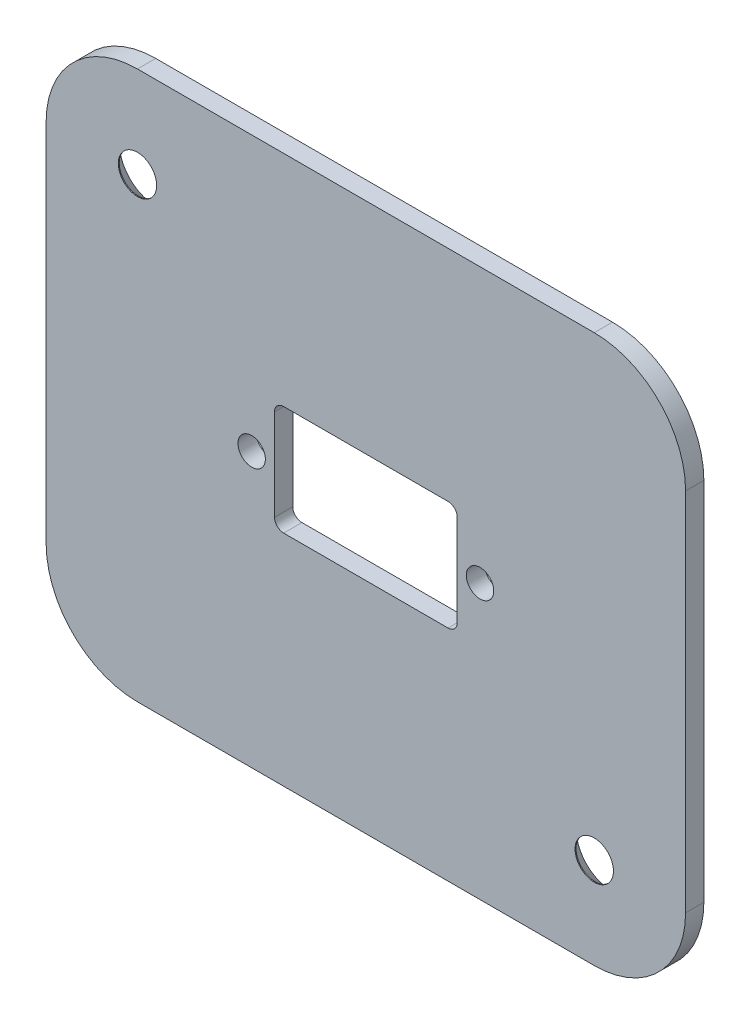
from build123d import *

# Parameters (mm, degrees)
ESQUISSE1_W             = 70
ESQUISSE1_H             = 60
BOSS_EXTRU_1_DEPTH      = 2
CONG_1_R                = 10
ESQUISSE2_R             = 2.1
ENL_V_MAT_EXTRU_1_DEPTH = 93.217135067
CHANFREIN1_SIZE         = 1.9
ESQUISSE3_R             = 1.5
ENL_V_MAT_EXTRU_2_DEPTH = 93.217135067
ENL_V_MAT_EXTRU_3_DEPTH = 1


with BuildPart() as part:
    # Esquisse1 → Boss.-Extru.1 (new body)
    with BuildSketch(Plane.XY):
        with Locations((35, 30)):
            Rectangle(ESQUISSE1_W, ESQUISSE1_H)
    extrude(amount=-BOSS_EXTRU_1_DEPTH)

    # Cong_1
    cong_1_edges = [part.edges().sort_by_distance(p)[0] for p in [
        (0, 60, -1),
        (70, 60, -1),
        (70, 0, -1),
        (0, 0, -1),
    ]]
    fillet(cong_1_edges, radius=CONG_1_R)

    # Esquisse2 → Enl_v. mat.-Extru.1 (cut, through all)
    with BuildSketch(Plane.XY):
        with Locations((10, 50)):
            Circle(ESQUISSE2_R)
        with Locations((60, 10)):
            Circle(ESQUISSE2_R)
    extrude(amount=-ENL_V_MAT_EXTRU_1_DEPTH, mode=Mode.SUBTRACT)

    # Chanfrein1
    chanfrein1_edges = [part.edges().sort_by_distance(p)[0] for p in [
        (7.9, 50, -2),
        (57.9, 10, -2),
    ]]
    chamfer(chanfrein1_edges, length=CHANFREIN1_SIZE)

    # Esquisse3 → Enl_v. mat.-Extru.2 (cut, through all)
    with BuildSketch(Plane(origin=(0, 0, -2), x_dir=(-1, 0, 0), z_dir=(0, 0, -1))):
        with Locations((-22.5, 30)):
            Circle(ESQUISSE3_R)
        with Locations((-47.5, 30)):
            Circle(ESQUISSE3_R)
        with BuildLine():
            Line((-44, 36), (-26, 36))
            ThreePointArc((-26, 36), (-25.292893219, 35.707106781), (-25, 35))
            Line((-25, 35), (-25, 25))
            ThreePointArc((-25, 25), (-25.292893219, 24.292893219), (-26, 24))
            Line((-26, 24), (-44, 24))
            ThreePointArc((-44, 24), (-44.707106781, 24.292893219), (-45, 25))
            Line((-45, 25), (-45, 35))
            ThreePointArc((-45, 35), (-44.707106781, 35.707106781), (-44, 36))
        make_face()
    extrude(amount=-ENL_V_MAT_EXTRU_2_DEPTH, mode=Mode.SUBTRACT)

    # Esquisse4 → Enl_v. mat.-Extru.3 (cut)
    # profile 1 of 4: a face of its own
    with BuildSketch(Plane(origin=(0, 0, -2), x_dir=(-1, 0, 0), z_dir=(0, 0, -1))):
        with BuildLine():
            Line((-39.296031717, 22.173881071), (-39.054144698, 21.983877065))
            Line((-39.054144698, 21.983877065), (-39.978924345, 20.569714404))
            add(Edge.make_bspline(
                [(-39.978924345, 20.569714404), (-39.917354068, 20.579528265), (-39.797254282, 20.59867131), (-39.675688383, 20.601829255), (-39.616444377, 20.603368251)],
                knots=[0, 0, 0, 0, 1.025318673, 2, 2, 2, 2], degree=3))
            add(Edge.make_bspline(
                [(-39.616444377, 20.603368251), (-39.580871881, 20.602412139), (-39.510848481, 20.600530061), (-39.408041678, 20.586046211), (-39.309252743, 20.563221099), (-39.21489113, 20.529948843), (-39.124618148, 20.487446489), (-39.037915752, 20.436507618), (-38.956413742, 20.374501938), (-38.879062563, 20.305236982), (-38.808835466, 20.228519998), (-38.74665941, 20.147118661), (-38.694432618, 20.06111778), (-38.652058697, 19.970560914), (-38.619153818, 19.875587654), (-38.595166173, 19.776319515), (-38.58098658, 19.672688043), (-38.579061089, 19.602209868), (-38.578082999, 19.566409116)],
                knots=[0, 0, 0, 0, 1.04369286, 2.054478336, 3.041073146, 4.015093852, 4.984733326, 5.965804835, 6.960378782, 7.985147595, 9.009457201, 10.008161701, 10.986880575, 11.956520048, 12.937015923, 13.931873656, 14.949455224, 16, 16, 16, 16], degree=3))
            add(Edge.make_bspline(
                [(-38.578082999, 19.566409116), (-38.579506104, 19.517429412), (-38.582306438, 19.421048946), (-38.610210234, 19.28067224), (-38.653569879, 19.146939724), (-38.715547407, 19.021986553), (-38.79252979, 18.905983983), (-38.886407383, 18.803198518), (-38.993850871, 18.71152848), (-39.115337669, 18.634871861), (-39.246080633, 18.57226881), (-39.383432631, 18.527303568), (-39.526059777, 18.499620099), (-39.622864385, 18.496149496), (-39.671832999, 18.494393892)],
                knots=[0, 0, 0, 0, 1.031375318, 2.029502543, 3.004789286, 3.987476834, 4.960371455, 5.9300674, 6.912260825, 7.929083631, 8.949397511, 9.960523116, 10.96833055, 12, 12, 12, 12], degree=3))
            add(Edge.make_bspline(
                [(-39.671832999, 18.494393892), (-39.7189297, 18.495922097), (-39.812220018, 18.498949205), (-39.949452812, 18.525915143), (-40.081315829, 18.569622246), (-40.20688521, 18.629836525), (-40.323205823, 18.705894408), (-40.42727146, 18.797456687), (-40.518563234, 18.902566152), (-40.594537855, 19.021206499), (-40.654796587, 19.148696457), (-40.699986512, 19.281633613), (-40.726382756, 19.419533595), (-40.730071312, 19.513014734), (-40.731929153, 19.56009902)],
                knots=[0, 0, 0, 0, 1.012016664, 2.004627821, 2.994792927, 3.992885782, 4.990978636, 5.973936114, 6.964471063, 7.975201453, 8.993600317, 9.990122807, 10.98767138, 12, 12, 12, 12], degree=3))
            add(Edge.make_bspline(
                [(-40.731929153, 19.56009902), (-40.730747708, 19.596143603), (-40.728335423, 19.669739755), (-40.711492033, 19.781203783), (-40.684427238, 19.895254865), (-40.654116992, 19.992009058), (-40.622091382, 20.07127058), (-40.595438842, 20.135174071), (-40.562264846, 20.200935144), (-40.526891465, 20.27080878), (-40.486134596, 20.342994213), (-40.441818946, 20.418697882), (-40.392719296, 20.49671581), (-40.358299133, 20.549660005), (-40.340703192, 20.576725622)],
                knots=[0, 0, 0, 0, 1.173818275, 2.396712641, 3.66331629, 4.989737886, 5.693666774, 6.447286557, 7.243889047, 8.091586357, 8.998013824, 9.943181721, 10.948533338, 12, 12, 12, 12], degree=3))
            Line((-40.340703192, 20.576725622), (-39.296031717, 22.173881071))
        make_face()
        with BuildLine():
            add(Edge.make_bspline(
                [(-39.682349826, 20.244393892), (-39.709012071, 20.243615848), (-39.76109118, 20.242096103), (-39.837498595, 20.233270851), (-39.909811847, 20.216651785), (-39.97898898, 20.195485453), (-40.043736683, 20.166382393), (-40.104525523, 20.131030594), (-40.161590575, 20.089409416), (-40.214334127, 20.042108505), (-40.26215379, 19.990320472), (-40.303334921, 19.93485095), (-40.338857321, 19.877036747), (-40.36773914, 19.816394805), (-40.390229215, 19.752948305), (-40.406497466, 19.686989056), (-40.415551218, 19.61807475), (-40.417057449, 19.571342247), (-40.417826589, 19.547478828)],
                knots=[0, 0, 0, 0, 1.129588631, 2.206414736, 3.251139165, 4.268635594, 5.265702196, 6.250456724, 7.242448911, 8.251968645, 9.246821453, 10.222880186, 11.173611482, 12.116736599, 13.062300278, 14.020270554, 14.989073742, 16, 16, 16, 16], degree=3))
            add(Edge.make_bspline(
                [(-40.417826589, 19.547478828), (-40.417200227, 19.523828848), (-40.415972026, 19.477454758), (-40.404819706, 19.409115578), (-40.387784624, 19.34335067), (-40.362444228, 19.280499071), (-40.33221734, 19.219602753), (-40.292312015, 19.162867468), (-40.24809523, 19.106847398), (-40.195241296, 19.055845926), (-40.138517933, 19.008389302), (-40.077916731, 18.966909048), (-40.014756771, 18.931422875), (-39.948185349, 18.903611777), (-39.879146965, 18.880787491), (-39.807066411, 18.864726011), (-39.731893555, 18.855645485), (-39.680971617, 18.854137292), (-39.655006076, 18.853368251)],
                knots=[0, 0, 0, 0, 0.989467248, 1.94019797, 2.891935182, 3.827694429, 4.772920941, 5.730924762, 6.725747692, 7.756678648, 8.79901574, 9.819492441, 10.826891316, 11.826466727, 12.835195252, 13.867842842, 14.912794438, 16, 16, 16, 16], degree=3))
            add(Edge.make_bspline(
                [(-39.655006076, 18.853368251), (-39.629040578, 18.854137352), (-39.578118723, 18.855645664), (-39.502945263, 18.864725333), (-39.430866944, 18.880789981), (-39.361820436, 18.903602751), (-39.295279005, 18.93145636), (-39.232174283, 18.96668828), (-39.172146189, 19.008644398), (-39.11538559, 19.055764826), (-39.062751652, 19.107137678), (-39.017474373, 19.162367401), (-38.978791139, 19.220061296), (-38.947356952, 19.280259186), (-38.922295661, 19.343388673), (-38.905174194, 19.409105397), (-38.894044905, 19.477457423), (-38.892813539, 19.523829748), (-38.892185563, 19.547478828)],
                knots=[0, 0, 0, 0, 1.087397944, 2.132534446, 3.165364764, 4.174271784, 5.174024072, 6.181601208, 7.194203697, 8.236725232, 9.267838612, 10.269026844, 11.221737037, 12.171628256, 13.107553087, 14.05945871, 15.010357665, 16, 16, 16, 16], degree=3))
            add(Edge.make_bspline(
                [(-38.892185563, 19.547478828), (-38.892735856, 19.571373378), (-38.893815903, 19.618270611), (-38.906031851, 19.686958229), (-38.922974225, 19.753283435), (-38.948557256, 19.816829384), (-38.9817938, 19.877345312), (-39.022277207, 19.935136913), (-39.069109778, 19.99064726), (-39.123207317, 20.042210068), (-39.182097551, 20.089357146), (-39.244713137, 20.130976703), (-39.31022111, 20.166101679), (-39.378555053, 20.195408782), (-39.450497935, 20.216558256), (-39.524888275, 20.233211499), (-39.602677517, 20.242073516), (-39.655454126, 20.243610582), (-39.682349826, 20.244393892)],
                knots=[0, 0, 0, 0, 0.978206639, 1.919901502, 2.851605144, 3.780102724, 4.718870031, 5.675451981, 6.667674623, 7.690630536, 8.733308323, 9.756129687, 10.767539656, 11.776269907, 12.797430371, 13.836405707, 14.897401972, 16, 16, 16, 16], degree=3))
        make_face(mode=Mode.SUBTRACT)
    # profile 2 of 4: a face of its own
    with BuildSketch(Plane(origin=(0, 0, -2), x_dir=(-1, 0, 0), z_dir=(0, 0, -1))):
        with BuildLine():
            add(Edge.make_bspline(
                [(-38.21910864, 20.332735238), (-38.218780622, 20.388832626), (-38.218143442, 20.49780261), (-38.211055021, 20.656587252), (-38.199279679, 20.805547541), (-38.183142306, 20.944690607), (-38.163504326, 21.074052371), (-38.137288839, 21.193287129), (-38.107476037, 21.302946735), (-38.072923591, 21.403388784), (-38.033935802, 21.495966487), (-37.991501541, 21.582391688), (-37.943936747, 21.66253362), (-37.893959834, 21.737671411), (-37.839547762, 21.806575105), (-37.782248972, 21.870217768), (-37.719827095, 21.927128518), (-37.654404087, 21.978974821), (-37.585387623, 22.024424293), (-37.514744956, 22.064457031), (-37.441989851, 22.098656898), (-37.366923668, 22.125547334), (-37.29022111, 22.147758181), (-37.211614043, 22.162947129), (-37.130972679, 22.172504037), (-37.076541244, 22.173417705), (-37.048936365, 22.173881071)],
                knots=[0, 0, 0, 0, 1.646270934, 3.197905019, 4.663502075, 6.030701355, 7.308322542, 8.50163776, 9.611534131, 10.641858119, 11.616356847, 12.558055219, 13.465016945, 14.349605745, 15.204443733, 16.039544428, 16.859896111, 17.680448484, 18.487036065, 19.28249412, 20.06191084, 20.843045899, 21.620316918, 22.403196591, 23.190181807, 24, 24, 24, 24], degree=3))
            add(Edge.make_bspline(
                [(-37.048936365, 22.173881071), (-37.021100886, 22.173393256), (-36.965744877, 22.172423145), (-36.883904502, 22.163099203), (-36.80395482, 22.147628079), (-36.726236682, 22.125707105), (-36.650111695, 22.098511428), (-36.576175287, 22.064424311), (-36.503968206, 22.024745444), (-36.434637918, 21.978121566), (-36.367423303, 21.92613929), (-36.30397534, 21.867376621), (-36.244288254, 21.802426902), (-36.187612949, 21.731985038), (-36.135557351, 21.654699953), (-36.085983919, 21.571915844), (-36.041611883, 21.482184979), (-35.998877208, 21.387004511), (-35.961990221, 21.283740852), (-35.928723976, 21.172976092), (-35.901845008, 21.053401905), (-35.879455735, 20.925645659), (-35.862110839, 20.789238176), (-35.849478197, 20.644471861), (-35.842805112, 20.49125147), (-35.841548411, 20.386493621), (-35.840903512, 20.332735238)],
                knots=[0, 0, 0, 0, 0.810914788, 1.612654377, 2.396697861, 3.181598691, 3.963628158, 4.749916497, 5.551656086, 6.361998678, 7.18212741, 8.025565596, 8.878627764, 9.750805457, 10.657531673, 11.591944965, 12.560506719, 13.57287815, 14.630710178, 15.753379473, 16.941251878, 18.199788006, 19.531962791, 20.947069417, 22.433333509, 24, 24, 24, 24], degree=3))
            add(Edge.make_bspline(
                [(-35.840903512, 20.332735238), (-35.841555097, 20.27921133), (-35.842824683, 20.174922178), (-35.849403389, 20.022391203), (-35.86236202, 19.878393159), (-35.878572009, 19.742582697), (-35.901022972, 19.615525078), (-35.928628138, 19.49678063), (-35.959278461, 19.385836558), (-35.997113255, 19.283601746), (-36.038523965, 19.188650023), (-36.083579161, 19.099982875), (-36.131848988, 19.016816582), (-36.184437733, 18.939816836), (-36.240491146, 18.868438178), (-36.301208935, 18.803940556), (-36.36487952, 18.744769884), (-36.432291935, 18.692118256), (-36.502703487, 18.646033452), (-36.574662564, 18.604819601), (-36.649445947, 18.571586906), (-36.7253589, 18.543051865), (-36.803487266, 18.521251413), (-36.883733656, 18.506177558), (-36.965689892, 18.495605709), (-37.021091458, 18.49479923), (-37.048936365, 18.494393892)],
                knots=[0, 0, 0, 0, 1.561518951, 3.042555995, 4.452378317, 5.7783523, 7.031515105, 8.214008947, 9.334062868, 10.386615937, 11.391082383, 12.354592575, 13.286541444, 14.194233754, 15.072674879, 15.931287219, 16.775624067, 17.606195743, 18.42308326, 19.229000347, 20.022332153, 20.807536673, 21.593273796, 22.3848459, 23.188221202, 24, 24, 24, 24], degree=3))
            add(Edge.make_bspline(
                [(-37.048936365, 18.494393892), (-37.076540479, 18.494860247), (-37.130970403, 18.495779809), (-37.211622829, 18.505293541), (-37.289905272, 18.520589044), (-37.366204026, 18.542005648), (-37.440910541, 18.568220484), (-37.513006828, 18.602374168), (-37.583294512, 18.641708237), (-37.651586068, 18.686503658), (-37.716598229, 18.737825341), (-37.778696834, 18.79458963), (-37.836321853, 18.858213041), (-37.889955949, 18.927690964), (-37.940930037, 19.002384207), (-37.98781941, 19.08331258), (-38.031190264, 19.17015519), (-38.070833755, 19.263473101), (-38.105982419, 19.364628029), (-38.137030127, 19.474777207), (-38.161544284, 19.594892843), (-38.182527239, 19.72401021), (-38.199451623, 19.862684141), (-38.211005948, 20.010989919), (-38.218147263, 20.168835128), (-38.218782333, 20.277104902), (-38.21910864, 20.332735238)],
                knots=[0, 0, 0, 0, 0.810891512, 1.598919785, 2.382837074, 3.152667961, 3.926044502, 4.706494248, 5.493654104, 6.291793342, 7.103789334, 7.925228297, 8.761435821, 9.622817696, 10.50288917, 11.416980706, 12.369136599, 13.353924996, 14.394355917, 15.514179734, 16.714354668, 17.994756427, 19.357759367, 20.818452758, 22.365282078, 24, 24, 24, 24], degree=3))
        make_face()
        with BuildLine():
            add(Edge.make_bspline(
                [(-37.905006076, 20.334137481), (-37.904886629, 20.287388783), (-37.904654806, 20.196658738), (-37.898598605, 20.064815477), (-37.890348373, 19.941845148), (-37.879707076, 19.827591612), (-37.863904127, 19.722441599), (-37.84619734, 19.625671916), (-37.82464925, 19.537794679), (-37.799154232, 19.458206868), (-37.770115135, 19.3855578), (-37.738409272, 19.317956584), (-37.704348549, 19.254604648), (-37.666229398, 19.19607104), (-37.624714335, 19.142164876), (-37.580741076, 19.091932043), (-37.532668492, 19.047135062), (-37.466164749, 18.993408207), (-37.378368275, 18.937889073), (-37.267747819, 18.889542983), (-37.154079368, 18.859160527), (-37.076928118, 18.855296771), (-37.038419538, 18.853368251)],
                knots=[0, 0, 0, 0, 1.459021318, 2.831673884, 4.118529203, 5.306027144, 6.411944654, 7.436330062, 8.375795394, 9.233974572, 10.042671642, 10.816086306, 11.563610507, 12.285937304, 12.993564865, 13.685989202, 14.367179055, 15.041617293, 16.353048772, 17.594441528, 18.799311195, 20, 20, 20, 20], degree=3))
            add(Edge.make_bspline(
                [(-37.038419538, 18.853368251), (-36.999661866, 18.854966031), (-36.922226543, 18.858158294), (-36.809092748, 18.888957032), (-36.699262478, 18.935426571), (-36.613190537, 18.990374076), (-36.547707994, 19.042702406), (-36.500791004, 19.087317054), (-36.457728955, 19.137272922), (-36.41688688, 19.191172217), (-36.379427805, 19.250044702), (-36.345364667, 19.313607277), (-36.31428132, 19.382036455), (-36.296572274, 19.429806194), (-36.287518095, 19.454229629)],
                knots=[0, 0, 0, 0, 1.353760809, 2.704726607, 4.075137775, 5.516104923, 6.260822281, 7.007110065, 7.778089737, 8.566572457, 9.372053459, 10.217411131, 11.088608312, 12, 12, 12, 12], degree=3))
            add(Edge.make_bspline(
                [(-36.287518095, 19.454229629), (-36.276966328, 19.485459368), (-36.255541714, 19.548869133), (-36.227929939, 19.647232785), (-36.20618454, 19.750435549), (-36.186621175, 19.857860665), (-36.173268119, 19.970300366), (-36.162520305, 20.08740675), (-36.156189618, 20.209268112), (-36.155404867, 20.292063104), (-36.155006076, 20.334137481)],
                knots=[0, 0, 0, 0, 0.884706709, 1.796334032, 2.740027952, 3.714592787, 4.726048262, 5.777819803, 6.87074269, 8, 8, 8, 8], degree=3))
            add(Edge.make_bspline(
                [(-36.155006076, 20.334137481), (-36.155556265, 20.376205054), (-36.156632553, 20.458498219), (-36.160746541, 20.579016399), (-36.171370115, 20.69348416), (-36.183169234, 20.802394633), (-36.200566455, 20.905144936), (-36.219324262, 21.002595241), (-36.244525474, 21.093538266), (-36.271445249, 21.179397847), (-36.302255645, 21.259198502), (-36.336171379, 21.333312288), (-36.372393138, 21.402097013), (-36.411735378, 21.465363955), (-36.453731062, 21.523396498), (-36.499488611, 21.575031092), (-36.547192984, 21.62186806), (-36.614010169, 21.675330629), (-36.701484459, 21.729842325), (-36.810330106, 21.780008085), (-36.923600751, 21.808816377), (-37.000174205, 21.812878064), (-37.038419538, 21.814906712)],
                knots=[0, 0, 0, 0, 1.31362396, 2.569729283, 3.763502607, 4.902122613, 5.988968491, 7.01645872, 7.998833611, 8.933434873, 9.825090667, 10.667526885, 11.477055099, 12.250526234, 12.991942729, 13.710640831, 14.402115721, 15.076753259, 16.378508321, 17.609869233, 18.806226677, 20, 20, 20, 20], degree=3))
            add(Edge.make_bspline(
                [(-37.038419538, 21.814906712), (-37.07713013, 21.812875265), (-37.154621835, 21.808808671), (-37.26906979, 21.780115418), (-37.378774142, 21.730102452), (-37.466017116, 21.675150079), (-37.532880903, 21.622811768), (-37.579963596, 21.577425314), (-37.624109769, 21.52777906), (-37.664777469, 21.473377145), (-37.702866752, 21.414911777), (-37.737847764, 21.351923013), (-37.769365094, 21.284091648), (-37.79844963, 21.211475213), (-37.824022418, 21.131894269), (-37.845116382, 21.044125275), (-37.864603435, 20.947663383), (-37.878398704, 20.841943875), (-37.890662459, 20.727661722), (-37.898543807, 20.604384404), (-37.904675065, 20.472320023), (-37.904893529, 20.381120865), (-37.905006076, 20.334137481)],
                knots=[0, 0, 0, 0, 1.207732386, 2.417664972, 3.655092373, 4.956220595, 5.625982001, 6.301752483, 6.994047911, 7.697131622, 8.419323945, 9.170223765, 9.943494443, 10.752040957, 11.610060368, 12.549350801, 13.567764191, 14.679664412, 15.874934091, 17.154273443, 18.533957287, 20, 20, 20, 20], degree=3))
        make_face(mode=Mode.SUBTRACT)
    # profile 3 of 4: a face of its own
    with BuildSketch(Plane(origin=(0, 0, -2), x_dir=(-1, 0, 0), z_dir=(0, 0, -1))):
        Polygon((-35.481929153, 22.084137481), (-35.145390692, 22.084137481), (-33.978724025, 19.32592434), (-32.812057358, 22.084137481), (-32.475518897, 22.084137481), (-33.956288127, 18.584137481), (-34.001159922, 18.584137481), align=None)
    # profile 4 of 4: a face of its own
    with BuildSketch(Plane(origin=(0, 0, -2), x_dir=(-1, 0, 0), z_dir=(0, 0, -1))):
        with BuildLine():
            Line((-28.616544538, 21.441909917), (-28.891384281, 21.231573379))
            add(Edge.make_bspline(
                [(-28.891384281, 21.231573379), (-28.91099017, 21.254939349), (-28.949937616, 21.301356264), (-29.012596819, 21.366535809), (-29.077898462, 21.42760107), (-29.145817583, 21.48484295), (-29.217576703, 21.536259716), (-29.291437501, 21.584530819), (-29.368635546, 21.627798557), (-29.475387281, 21.680261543), (-29.615035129, 21.735007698), (-29.790829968, 21.780910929), (-29.974341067, 21.810132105), (-30.099538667, 21.813296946), (-30.163219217, 21.814906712)],
                knots=[0, 0, 0, 0, 0.757959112, 1.505699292, 2.245454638, 2.979532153, 3.711538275, 4.438200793, 5.171680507, 5.909471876, 7.393775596, 8.890124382, 10.418191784, 12, 12, 12, 12], degree=3))
            add(Edge.make_bspline(
                [(-30.163219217, 21.814906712), (-30.198302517, 21.81450275), (-30.268143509, 21.813698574), (-30.371791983, 21.803089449), (-30.473505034, 21.788178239), (-30.5732165, 21.766052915), (-30.670799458, 21.738080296), (-30.766891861, 21.704654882), (-30.86010246, 21.663300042), (-30.951720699, 21.617591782), (-31.03949991, 21.565964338), (-31.122554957, 21.509650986), (-31.200582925, 21.449281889), (-31.273645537, 21.384630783), (-31.341817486, 21.315988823), (-31.404604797, 21.242624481), (-31.461790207, 21.164772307), (-31.514507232, 21.0834589), (-31.561719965, 20.998921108), (-31.601249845, 20.910846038), (-31.636254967, 20.820741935), (-31.663954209, 20.727590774), (-31.685878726, 20.632048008), (-31.70100639, 20.53385722), (-31.711494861, 20.433223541), (-31.712295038, 20.365014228), (-31.712698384, 20.330631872)],
                knots=[0, 0, 0, 0, 1.054917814, 2.100044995, 3.131103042, 4.146048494, 5.169673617, 6.183595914, 7.203665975, 8.234915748, 9.262203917, 10.264457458, 11.251630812, 12.227803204, 13.197192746, 14.159520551, 15.12972552, 16.100847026, 17.073214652, 18.039054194, 19.002613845, 19.979014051, 20.95965708, 21.949030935, 22.966165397, 24, 24, 24, 24], degree=3))
            add(Edge.make_bspline(
                [(-31.712698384, 20.330631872), (-31.711436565, 20.278900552), (-31.708959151, 20.177332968), (-31.686910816, 20.028562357), (-31.653405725, 19.886041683), (-31.603190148, 19.750661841), (-31.541271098, 19.620753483), (-31.463030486, 19.49851463), (-31.372413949, 19.382098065), (-31.268139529, 19.274255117), (-31.153733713, 19.175741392), (-31.030985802, 19.08899081), (-30.900201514, 19.016675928), (-30.762824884, 18.956499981), (-30.61779877, 18.910243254), (-30.465383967, 18.87767913), (-30.305911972, 18.85643695), (-30.196942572, 18.854403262), (-30.141484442, 18.853368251)],
                knots=[0, 0, 0, 0, 1.029171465, 2.020641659, 2.987623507, 3.938342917, 4.889210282, 5.84687017, 6.821220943, 7.821438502, 8.827599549, 9.822697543, 10.807740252, 11.797342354, 12.80366471, 13.83203677, 14.896651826, 16, 16, 16, 16], degree=3))
            add(Edge.make_bspline(
                [(-30.141484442, 18.853368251), (-30.080381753, 18.85505703), (-29.960117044, 18.858380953), (-29.783749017, 18.886540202), (-29.614913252, 18.93219812), (-29.453600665, 18.996096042), (-29.300266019, 19.07916133), (-29.154669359, 19.179859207), (-29.016687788, 19.29914754), (-28.933716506, 19.390230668), (-28.891384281, 19.436701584)],
                knots=[0, 0, 0, 0, 1.028121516, 2.023589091, 2.998037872, 3.967518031, 4.937445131, 5.927275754, 6.942489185, 8, 8, 8, 8], degree=3))
            Line((-28.891384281, 19.436701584), (-28.616544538, 19.228468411))
            add(Edge.make_bspline(
                [(-28.616544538, 19.228468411), (-28.638662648, 19.199929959), (-28.682792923, 19.142989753), (-28.75425094, 19.062718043), (-28.829528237, 18.987214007), (-28.909183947, 18.917086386), (-28.992301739, 18.850931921), (-29.080374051, 18.790630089), (-29.172243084, 18.735339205), (-29.267597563, 18.684712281), (-29.366336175, 18.639795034), (-29.46834061, 18.601341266), (-29.573171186, 18.568216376), (-29.680832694, 18.540964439), (-29.791548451, 18.519693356), (-29.904918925, 18.505473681), (-30.0211888, 18.495731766), (-30.099630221, 18.49484385), (-30.139381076, 18.494393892)],
                knots=[0, 0, 0, 0, 0.986787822, 1.968848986, 2.935600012, 3.899624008, 4.868462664, 5.837806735, 6.815139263, 7.798259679, 8.787526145, 9.778297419, 10.776456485, 11.791383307, 12.812564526, 13.85620153, 14.913611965, 16, 16, 16, 16], degree=3))
            add(Edge.make_bspline(
                [(-30.139381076, 18.494393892), (-30.177024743, 18.494655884), (-30.251460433, 18.495173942), (-30.361359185, 18.503566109), (-30.468348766, 18.515015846), (-30.572123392, 18.532255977), (-30.673249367, 18.552600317), (-30.770809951, 18.579871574), (-30.865765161, 18.610420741), (-30.957733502, 18.646325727), (-31.046793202, 18.68684191), (-31.132657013, 18.732633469), (-31.215285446, 18.783315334), (-31.295490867, 18.837770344), (-31.37208845, 18.897747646), (-31.445741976, 18.96241428), (-31.516864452, 19.031552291), (-31.560867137, 19.081407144), (-31.582990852, 19.106473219)],
                knots=[0, 0, 0, 0, 1.114604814, 2.203992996, 3.262667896, 4.300477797, 5.318619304, 6.316056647, 7.298880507, 8.271930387, 9.238335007, 10.195173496, 11.151986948, 12.108099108, 13.064862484, 14.031167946, 15.010108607, 16, 16, 16, 16], degree=3))
            add(Edge.make_bspline(
                [(-31.582990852, 19.106473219), (-31.618426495, 19.150014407), (-31.688869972, 19.236571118), (-31.778995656, 19.376857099), (-31.856143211, 19.523325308), (-31.918519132, 19.676745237), (-31.967281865, 19.836772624), (-32.00106306, 20.003488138), (-32.023014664, 20.176736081), (-32.025524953, 20.294572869), (-32.026800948, 20.354470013)],
                knots=[0, 0, 0, 0, 0.994628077, 1.977248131, 2.950237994, 3.925870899, 4.908910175, 5.911660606, 6.938484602, 8, 8, 8, 8], degree=3))
            add(Edge.make_bspline(
                [(-32.026800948, 20.354470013), (-32.025245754, 20.417425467), (-32.022186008, 20.541286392), (-31.996190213, 20.723060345), (-31.954371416, 20.897211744), (-31.894974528, 21.063415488), (-31.819669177, 21.222545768), (-31.726642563, 21.373386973), (-31.616975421, 21.516903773), (-31.491527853, 21.650918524), (-31.353960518, 21.773457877), (-31.206641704, 21.881264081), (-31.049859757, 21.970981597), (-30.885341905, 22.045977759), (-30.711856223, 22.103622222), (-30.529772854, 22.143975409), (-30.33943394, 22.169092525), (-30.209571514, 22.172267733), (-30.143587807, 22.173881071)],
                knots=[0, 0, 0, 0, 1.032925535, 2.032216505, 3.007276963, 3.968222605, 4.92396291, 5.891752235, 6.871517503, 7.883894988, 8.900124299, 9.891468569, 10.874487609, 11.85992873, 12.854644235, 13.869047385, 14.917252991, 16, 16, 16, 16], degree=3))
            add(Edge.make_bspline(
                [(-30.143587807, 22.173881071), (-30.103373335, 22.173398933), (-30.023772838, 22.172444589), (-29.906020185, 22.163138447), (-29.791377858, 22.147624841), (-29.679766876, 22.126508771), (-29.57064426, 22.100301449), (-29.464844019, 22.066161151), (-29.361745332, 22.02712462), (-29.261998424, 21.982166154), (-29.166081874, 21.931699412), (-29.074025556, 21.876283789), (-28.986560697, 21.815987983), (-28.903071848, 21.751324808), (-28.824955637, 21.680926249), (-28.749994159, 21.606728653), (-28.680733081, 21.526594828), (-28.637979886, 21.470189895), (-28.616544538, 21.441909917)],
                knots=[0, 0, 0, 0, 1.096760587, 2.17092713, 3.219439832, 4.250915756, 5.268269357, 6.278326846, 7.281116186, 8.274029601, 9.260640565, 10.235837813, 11.203064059, 12.156899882, 13.114053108, 14.069676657, 15.032185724, 16, 16, 16, 16], degree=3))
        make_face()
    extrude(amount=-ENL_V_MAT_EXTRU_3_DEPTH, mode=Mode.SUBTRACT)


solid = part.part
